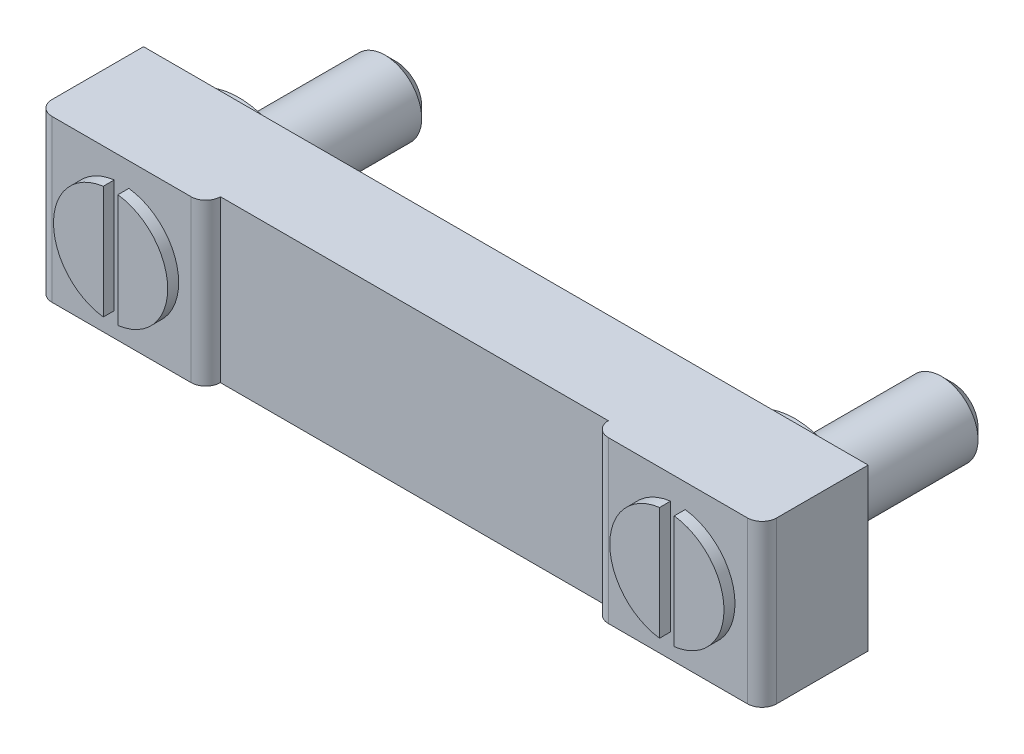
ISO-10303-21;
HEADER;
FILE_DESCRIPTION(('STEP AP214'),'2;1');
FILE_NAME('part.step','',(''),(''),'','','');
FILE_SCHEMA(('AUTOMOTIVE_DESIGN { 1 0 10303 214 1 1 1 1 }'));
ENDSEC;
DATA;
#1=APPLICATION_CONTEXT('core data for automotive mechanical design processes');
#2=APPLICATION_PROTOCOL_DEFINITION('international standard','automotive_design',2000,#1);
#3=PRODUCT_CONTEXT('',#1,'mechanical');
#4=PRODUCT('Part','Part','',(#3));
#5=PRODUCT_RELATED_PRODUCT_CATEGORY('part','',(#4));
#6=PRODUCT_DEFINITION_FORMATION('','',#4);
#7=PRODUCT_DEFINITION_CONTEXT('part definition',#1,'design');
#8=PRODUCT_DEFINITION('design','',#6,#7);
#9=PRODUCT_DEFINITION_SHAPE('','',#8);
#10=(LENGTH_UNIT() NAMED_UNIT(*) SI_UNIT(.MILLI.,.METRE.));
#11=(NAMED_UNIT(*) PLANE_ANGLE_UNIT() SI_UNIT($,.RADIAN.));
#12=(NAMED_UNIT(*) SI_UNIT($,.STERADIAN.) SOLID_ANGLE_UNIT());
#13=UNCERTAINTY_MEASURE_WITH_UNIT(LENGTH_MEASURE(1.E-05),#10,'distance_accuracy_value','');
#14=(GEOMETRIC_REPRESENTATION_CONTEXT(3) GLOBAL_UNCERTAINTY_ASSIGNED_CONTEXT((#13)) GLOBAL_UNIT_ASSIGNED_CONTEXT((#10,
#11,#12)) REPRESENTATION_CONTEXT('',''));
#15=CARTESIAN_POINT('',(0.,0.,0.));
#16=DIRECTION('',(0.,0.,1.));
#17=DIRECTION('',(1.,0.,0.));
#18=AXIS2_PLACEMENT_3D('',#15,#16,#17);
#19=CARTESIAN_POINT('',(10.,-11.,0.));
#20=DIRECTION('',(0.,0.,1.));
#21=DIRECTION('',(0.,1.,0.));
#22=AXIS2_PLACEMENT_3D('',#19,#20,#21);
#23=PLANE('',#22);
#24=CARTESIAN_POINT('',(76.,0.,0.));
#25=DIRECTION('',(0.,0.,1.));
#26=DIRECTION('',(0.,1.,0.));
#27=AXIS2_PLACEMENT_3D('',#24,#25,#26);
#28=CIRCLE('',#27,10.);
#29=CARTESIAN_POINT('',(76.,10.,0.));
#30=VERTEX_POINT('',#29);
#31=EDGE_CURVE('E142',#30,#30,#28,.T.);
#32=ORIENTED_EDGE('',*,*,#31,.F.);
#33=EDGE_LOOP('',(#32));
#34=FACE_BOUND('',#33,.T.);
#35=CARTESIAN_POINT('',(76.,0.,0.));
#36=DIRECTION('',(0.,0.,1.));
#37=DIRECTION('',(0.,1.,0.));
#38=AXIS2_PLACEMENT_3D('',#35,#36,#37);
#39=CIRCLE('',#38,5.);
#40=CARTESIAN_POINT('',(76.,5.,0.));
#41=VERTEX_POINT('',#40);
#42=EDGE_CURVE('E299',#41,#41,#39,.F.);
#43=ORIENTED_EDGE('',*,*,#42,.F.);
#44=EDGE_LOOP('',(#43));
#45=FACE_BOUND('',#44,.T.);
#46=ADVANCED_FACE('F14',(#34,#45),#23,.F.);
#47=CARTESIAN_POINT('',(86.,-11.,1.49999999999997));
#48=DIRECTION('',(0.,0.,1.));
#49=DIRECTION('',(-1.,0.,0.));
#50=AXIS2_PLACEMENT_3D('',#47,#48,#49);
#51=PLANE('',#50);
#52=DIRECTION('',(1.,0.,0.));
#53=VECTOR('',#52,1.);
#54=CARTESIAN_POINT('',(86.,11.,1.49999999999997));
#55=LINE('',#54,#53);
#56=CARTESIAN_POINT('',(-11.5,11.,1.49999999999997));
#57=VERTEX_POINT('',#56);
#58=CARTESIAN_POINT('',(87.5,11.,1.49999999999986));
#59=VERTEX_POINT('',#58);
#60=EDGE_CURVE('E220',#57,#59,#55,.T.);
#61=ORIENTED_EDGE('',*,*,#60,.T.);
#62=DIRECTION('',(0.,1.,0.));
#63=VECTOR('',#62,1.);
#64=CARTESIAN_POINT('',(87.5,-11.,1.49999999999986));
#65=LINE('',#64,#63);
#66=CARTESIAN_POINT('',(87.5,-11.,1.49999999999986));
#67=VERTEX_POINT('',#66);
#68=EDGE_CURVE('E278',#67,#59,#65,.T.);
#69=ORIENTED_EDGE('',*,*,#68,.F.);
#70=DIRECTION('',(1.,0.,0.));
#71=VECTOR('',#70,1.);
#72=CARTESIAN_POINT('',(-11.5,-11.,1.49999999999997));
#73=LINE('',#72,#71);
#74=CARTESIAN_POINT('',(-11.5,-11.,1.49999999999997));
#75=VERTEX_POINT('',#74);
#76=EDGE_CURVE('E241',#75,#67,#73,.T.);
#77=ORIENTED_EDGE('',*,*,#76,.F.);
#78=DIRECTION('',(0.,1.,0.));
#79=VECTOR('',#78,1.);
#80=CARTESIAN_POINT('',(-11.5,-11.,1.49999999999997));
#81=LINE('',#80,#79);
#82=EDGE_CURVE('E281',#75,#57,#81,.T.);
#83=ORIENTED_EDGE('',*,*,#82,.T.);
#84=EDGE_LOOP('',(#61,#69,#77,#83));
#85=FACE_BOUND('',#84,.T.);
#86=CARTESIAN_POINT('',(0.,0.,1.49999999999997));
#87=DIRECTION('',(0.,0.,1.));
#88=DIRECTION('',(0.,1.,0.));
#89=AXIS2_PLACEMENT_3D('',#86,#87,#88);
#90=CIRCLE('',#89,10.);
#91=CARTESIAN_POINT('',(0.,10.,1.49999999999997));
#92=VERTEX_POINT('',#91);
#93=EDGE_CURVE('E177',#92,#92,#90,.F.);
#94=ORIENTED_EDGE('',*,*,#93,.F.);
#95=EDGE_LOOP('',(#94));
#96=FACE_BOUND('',#95,.T.);
#97=CARTESIAN_POINT('',(76.,0.,1.50000000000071));
#98=DIRECTION('',(0.,0.,1.));
#99=DIRECTION('',(-1.,0.,0.));
#100=AXIS2_PLACEMENT_3D('',#97,#98,#99);
#101=CIRCLE('',#100,10.);
#102=CARTESIAN_POINT('',(66.,0.,1.50000000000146));
#103=VERTEX_POINT('',#102);
#104=EDGE_CURVE('E296',#103,#103,#101,.F.);
#105=ORIENTED_EDGE('',*,*,#104,.F.);
#106=EDGE_LOOP('',(#105));
#107=FACE_BOUND('',#106,.T.);
#108=ADVANCED_FACE('F319',(#85,#96,#107),#51,.F.);
#109=CARTESIAN_POINT('',(85.5,-11.,16.));
#110=DIRECTION('',(0.,0.,-1.));
#111=DIRECTION('',(0.,-1.,0.));
#112=AXIS2_PLACEMENT_3D('',#109,#110,#111);
#113=PLANE('',#112);
#114=CARTESIAN_POINT('',(76.,0.,16.));
#115=DIRECTION('',(0.,0.,1.));
#116=DIRECTION('',(0.,1.,0.));
#117=AXIS2_PLACEMENT_3D('',#114,#115,#116);
#118=CIRCLE('',#117,7.8);
#119=CARTESIAN_POINT('',(75.,7.73563184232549,16.));
#120=VERTEX_POINT('',#119);
#121=CARTESIAN_POINT('',(75.,-7.73563184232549,16.));
#122=VERTEX_POINT('',#121);
#123=EDGE_CURVE('E156',#120,#122,#118,.T.);
#124=ORIENTED_EDGE('',*,*,#123,.F.);
#125=DIRECTION('',(0.,1.,0.));
#126=VECTOR('',#125,1.);
#127=CARTESIAN_POINT('',(75.,-7.73563184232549,16.));
#128=LINE('',#127,#126);
#129=EDGE_CURVE('E35',#122,#120,#128,.T.);
#130=ORIENTED_EDGE('',*,*,#129,.F.);
#131=EDGE_LOOP('',(#124,#130));
#132=FACE_BOUND('',#131,.T.);
#133=DIRECTION('',(-1.,0.,0.));
#134=VECTOR('',#133,1.);
#135=CARTESIAN_POINT('',(85.5,11.,16.));
#136=LINE('',#135,#134);
#137=CARTESIAN_POINT('',(85.5,11.,16.));
#138=VERTEX_POINT('',#137);
#139=CARTESIAN_POINT('',(66.5,11.,16.));
#140=VERTEX_POINT('',#139);
#141=EDGE_CURVE('E226',#138,#140,#136,.T.);
#142=ORIENTED_EDGE('',*,*,#141,.T.);
#143=DIRECTION('',(0.,1.,0.));
#144=VECTOR('',#143,1.);
#145=CARTESIAN_POINT('',(66.5,-11.,16.));
#146=LINE('',#145,#144);
#147=CARTESIAN_POINT('',(66.5,-11.,16.));
#148=VERTEX_POINT('',#147);
#149=EDGE_CURVE('E269',#148,#140,#146,.T.);
#150=ORIENTED_EDGE('',*,*,#149,.F.);
#151=DIRECTION('',(-1.,0.,0.));
#152=VECTOR('',#151,1.);
#153=CARTESIAN_POINT('',(85.5,-11.,16.));
#154=LINE('',#153,#152);
#155=CARTESIAN_POINT('',(85.5,-11.,16.));
#156=VERTEX_POINT('',#155);
#157=EDGE_CURVE('E247',#156,#148,#154,.T.);
#158=ORIENTED_EDGE('',*,*,#157,.F.);
#159=DIRECTION('',(0.,1.,0.));
#160=VECTOR('',#159,1.);
#161=CARTESIAN_POINT('',(85.5,-11.,16.));
#162=LINE('',#161,#160);
#163=EDGE_CURVE('E272',#156,#138,#162,.T.);
#164=ORIENTED_EDGE('',*,*,#163,.T.);
#165=EDGE_LOOP('',(#142,#150,#158,#164));
#166=FACE_BOUND('',#165,.T.);
#167=CARTESIAN_POINT('',(76.,0.,16.));
#168=DIRECTION('',(0.,0.,1.));
#169=DIRECTION('',(0.,1.,0.));
#170=AXIS2_PLACEMENT_3D('',#167,#168,#169);
#171=CIRCLE('',#170,7.8);
#172=CARTESIAN_POINT('',(77.,-7.73563184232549,16.));
#173=VERTEX_POINT('',#172);
#174=CARTESIAN_POINT('',(77.,7.73563184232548,16.));
#175=VERTEX_POINT('',#174);
#176=EDGE_CURVE('E137',#173,#175,#171,.T.);
#177=ORIENTED_EDGE('',*,*,#176,.F.);
#178=DIRECTION('',(0.,-1.,0.));
#179=VECTOR('',#178,1.);
#180=CARTESIAN_POINT('',(77.,-7.73563184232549,16.));
#181=LINE('',#180,#179);
#182=EDGE_CURVE('E28',#175,#173,#181,.T.);
#183=ORIENTED_EDGE('',*,*,#182,.F.);
#184=EDGE_LOOP('',(#177,#183));
#185=FACE_BOUND('',#184,.T.);
#186=ADVANCED_FACE('F138',(#132,#166,#185),#113,.F.);
#187=CARTESIAN_POINT('',(10.,-11.,0.));
#188=DIRECTION('',(0.,0.,1.));
#189=DIRECTION('',(0.,1.,0.));
#190=AXIS2_PLACEMENT_3D('',#187,#188,#189);
#191=PLANE('',#190);
#192=CARTESIAN_POINT('',(0.,0.,0.));
#193=DIRECTION('',(0.,0.,-1.));
#194=DIRECTION('',(0.,-1.,0.));
#195=AXIS2_PLACEMENT_3D('',#192,#193,#194);
#196=CIRCLE('',#195,10.);
#197=CARTESIAN_POINT('',(0.,-10.,0.));
#198=VERTEX_POINT('',#197);
#199=EDGE_CURVE('E174',#198,#198,#196,.T.);
#200=ORIENTED_EDGE('',*,*,#199,.T.);
#201=EDGE_LOOP('',(#200));
#202=FACE_BOUND('',#201,.T.);
#203=CARTESIAN_POINT('',(0.,0.,0.));
#204=DIRECTION('',(0.,0.,1.));
#205=DIRECTION('',(0.,1.,0.));
#206=AXIS2_PLACEMENT_3D('',#203,#204,#205);
#207=CIRCLE('',#206,5.);
#208=CARTESIAN_POINT('',(0.,5.,0.));
#209=VERTEX_POINT('',#208);
#210=EDGE_CURVE('E287',#209,#209,#207,.F.);
#211=ORIENTED_EDGE('',*,*,#210,.F.);
#212=EDGE_LOOP('',(#211));
#213=FACE_BOUND('',#212,.T.);
#214=ADVANCED_FACE('F408',(#202,#213),#191,.F.);
#215=CARTESIAN_POINT('',(-9.5,-11.,16.));
#216=DIRECTION('',(0.,0.,-1.));
#217=DIRECTION('',(0.,-1.,0.));
#218=AXIS2_PLACEMENT_3D('',#215,#216,#217);
#219=PLANE('',#218);
#220=CARTESIAN_POINT('',(0.,0.,16.));
#221=DIRECTION('',(0.,0.,1.));
#222=DIRECTION('',(0.,1.,0.));
#223=AXIS2_PLACEMENT_3D('',#220,#221,#222);
#224=CIRCLE('',#223,7.8);
#225=CARTESIAN_POINT('',(-1.,7.73563184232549,16.));
#226=VERTEX_POINT('',#225);
#227=CARTESIAN_POINT('',(-1.,-7.73563184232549,16.));
#228=VERTEX_POINT('',#227);
#229=EDGE_CURVE('E197',#226,#228,#224,.T.);
#230=ORIENTED_EDGE('',*,*,#229,.F.);
#231=DIRECTION('',(0.,1.,0.));
#232=VECTOR('',#231,1.);
#233=CARTESIAN_POINT('',(-1.,-7.73563184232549,16.));
#234=LINE('',#233,#232);
#235=EDGE_CURVE('E200',#228,#226,#234,.T.);
#236=ORIENTED_EDGE('',*,*,#235,.F.);
#237=EDGE_LOOP('',(#230,#236));
#238=FACE_BOUND('',#237,.T.);
#239=DIRECTION('',(-1.,0.,0.));
#240=VECTOR('',#239,1.);
#241=CARTESIAN_POINT('',(-9.5,11.,16.));
#242=LINE('',#241,#240);
#243=CARTESIAN_POINT('',(9.4999999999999,11.,16.));
#244=VERTEX_POINT('',#243);
#245=CARTESIAN_POINT('',(-9.5,11.,16.));
#246=VERTEX_POINT('',#245);
#247=EDGE_CURVE('E234',#244,#246,#242,.T.);
#248=ORIENTED_EDGE('',*,*,#247,.T.);
#249=DIRECTION('',(0.,1.,0.));
#250=VECTOR('',#249,1.);
#251=CARTESIAN_POINT('',(-9.5,-11.,16.));
#252=LINE('',#251,#250);
#253=CARTESIAN_POINT('',(-9.5,-11.,16.));
#254=VERTEX_POINT('',#253);
#255=EDGE_CURVE('E257',#254,#246,#252,.T.);
#256=ORIENTED_EDGE('',*,*,#255,.F.);
#257=DIRECTION('',(-1.,0.,0.));
#258=VECTOR('',#257,1.);
#259=CARTESIAN_POINT('',(-9.5,-11.,16.));
#260=LINE('',#259,#258);
#261=CARTESIAN_POINT('',(9.4999999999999,-11.,16.));
#262=VERTEX_POINT('',#261);
#263=EDGE_CURVE('E255',#262,#254,#260,.T.);
#264=ORIENTED_EDGE('',*,*,#263,.F.);
#265=DIRECTION('',(0.,1.,0.));
#266=VECTOR('',#265,1.);
#267=CARTESIAN_POINT('',(9.4999999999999,-11.,16.));
#268=LINE('',#267,#266);
#269=EDGE_CURVE('E260',#262,#244,#268,.T.);
#270=ORIENTED_EDGE('',*,*,#269,.T.);
#271=EDGE_LOOP('',(#248,#256,#264,#270));
#272=FACE_BOUND('',#271,.T.);
#273=CARTESIAN_POINT('',(0.,0.,16.));
#274=DIRECTION('',(0.,0.,1.));
#275=DIRECTION('',(0.,1.,0.));
#276=AXIS2_PLACEMENT_3D('',#273,#274,#275);
#277=CIRCLE('',#276,7.8);
#278=CARTESIAN_POINT('',(1.,-7.73563184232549,16.));
#279=VERTEX_POINT('',#278);
#280=CARTESIAN_POINT('',(1.,7.73563184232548,16.));
#281=VERTEX_POINT('',#280);
#282=EDGE_CURVE('E180',#279,#281,#277,.T.);
#283=ORIENTED_EDGE('',*,*,#282,.F.);
#284=DIRECTION('',(0.,-1.,0.));
#285=VECTOR('',#284,1.);
#286=CARTESIAN_POINT('',(1.,-7.73563184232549,16.));
#287=LINE('',#286,#285);
#288=EDGE_CURVE('E183',#281,#279,#287,.T.);
#289=ORIENTED_EDGE('',*,*,#288,.F.);
#290=EDGE_LOOP('',(#283,#289));
#291=FACE_BOUND('',#290,.T.);
#292=ADVANCED_FACE('F405',(#238,#272,#291),#219,.F.);
#293=CARTESIAN_POINT('',(-9.5,-11.,14.));
#294=DIRECTION('',(0.,1.,0.));
#295=DIRECTION('',(0.,0.,-1.));
#296=AXIS2_PLACEMENT_3D('',#293,#294,#295);
#297=CYLINDRICAL_SURFACE('',#296,2.);
#298=CARTESIAN_POINT('',(-9.5,11.,14.));
#299=DIRECTION('',(0.,-1.,0.));
#300=DIRECTION('',(0.,0.,-1.));
#301=AXIS2_PLACEMENT_3D('',#298,#299,#300);
#302=CIRCLE('',#301,2.);
#303=CARTESIAN_POINT('',(-11.5,11.,14.));
#304=VERTEX_POINT('',#303);
#305=EDGE_CURVE('E214',#246,#304,#302,.T.);
#306=ORIENTED_EDGE('',*,*,#305,.T.);
#307=DIRECTION('',(0.,1.,0.));
#308=VECTOR('',#307,1.);
#309=CARTESIAN_POINT('',(-11.5,-11.,14.));
#310=LINE('',#309,#308);
#311=CARTESIAN_POINT('',(-11.5,-11.,14.));
#312=VERTEX_POINT('',#311);
#313=EDGE_CURVE('E284',#312,#304,#310,.T.);
#314=ORIENTED_EDGE('',*,*,#313,.F.);
#315=CARTESIAN_POINT('',(-9.5,-11.,14.));
#316=DIRECTION('',(0.,-1.,0.));
#317=DIRECTION('',(0.,0.,-1.));
#318=AXIS2_PLACEMENT_3D('',#315,#316,#317);
#319=CIRCLE('',#318,2.);
#320=EDGE_CURVE('E236',#254,#312,#319,.T.);
#321=ORIENTED_EDGE('',*,*,#320,.F.);
#322=ORIENTED_EDGE('',*,*,#255,.T.);
#323=EDGE_LOOP('',(#306,#314,#321,#322));
#324=FACE_BOUND('',#323,.T.);
#325=ADVANCED_FACE('F16',(#324),#297,.T.);
#326=CARTESIAN_POINT('',(-11.5,-11.,14.));
#327=DIRECTION('',(1.,0.,0.));
#328=DIRECTION('',(0.,1.,0.));
#329=AXIS2_PLACEMENT_3D('',#326,#327,#328);
#330=PLANE('',#329);
#331=DIRECTION('',(0.,0.,-1.));
#332=VECTOR('',#331,1.);
#333=CARTESIAN_POINT('',(-11.5,11.,14.));
#334=LINE('',#333,#332);
#335=EDGE_CURVE('E217',#304,#57,#334,.T.);
#336=ORIENTED_EDGE('',*,*,#335,.T.);
#337=ORIENTED_EDGE('',*,*,#82,.F.);
#338=DIRECTION('',(0.,0.,-1.));
#339=VECTOR('',#338,1.);
#340=CARTESIAN_POINT('',(-11.5,-11.,14.));
#341=LINE('',#340,#339);
#342=EDGE_CURVE('E239',#312,#75,#341,.T.);
#343=ORIENTED_EDGE('',*,*,#342,.F.);
#344=ORIENTED_EDGE('',*,*,#313,.T.);
#345=EDGE_LOOP('',(#336,#337,#343,#344));
#346=FACE_BOUND('',#345,.T.);
#347=ADVANCED_FACE('F429',(#346),#330,.F.);
#348=CARTESIAN_POINT('',(87.5,-11.,14.));
#349=DIRECTION('',(-1.,0.,0.));
#350=DIRECTION('',(0.,-1.,0.));
#351=AXIS2_PLACEMENT_3D('',#348,#349,#350);
#352=PLANE('',#351);
#353=DIRECTION('',(0.,0.,1.));
#354=VECTOR('',#353,1.);
#355=CARTESIAN_POINT('',(87.5,11.,14.));
#356=LINE('',#355,#354);
#357=CARTESIAN_POINT('',(87.5,11.,14.));
#358=VERTEX_POINT('',#357);
#359=EDGE_CURVE('E222',#59,#358,#356,.T.);
#360=ORIENTED_EDGE('',*,*,#359,.T.);
#361=DIRECTION('',(0.,1.,0.));
#362=VECTOR('',#361,1.);
#363=CARTESIAN_POINT('',(87.5,-11.,14.));
#364=LINE('',#363,#362);
#365=CARTESIAN_POINT('',(87.5,-11.,14.));
#366=VERTEX_POINT('',#365);
#367=EDGE_CURVE('E275',#366,#358,#364,.T.);
#368=ORIENTED_EDGE('',*,*,#367,.F.);
#369=DIRECTION('',(0.,0.,1.));
#370=VECTOR('',#369,1.);
#371=CARTESIAN_POINT('',(87.5,-11.,14.));
#372=LINE('',#371,#370);
#373=EDGE_CURVE('E243',#67,#366,#372,.T.);
#374=ORIENTED_EDGE('',*,*,#373,.F.);
#375=ORIENTED_EDGE('',*,*,#68,.T.);
#376=EDGE_LOOP('',(#360,#368,#374,#375));
#377=FACE_BOUND('',#376,.T.);
#378=ADVANCED_FACE('F426',(#377),#352,.F.);
#379=CARTESIAN_POINT('',(85.5,-11.,14.));
#380=DIRECTION('',(0.,1.,0.));
#381=DIRECTION('',(0.,0.,-1.));
#382=AXIS2_PLACEMENT_3D('',#379,#380,#381);
#383=CYLINDRICAL_SURFACE('',#382,2.);
#384=CARTESIAN_POINT('',(85.5,11.,14.));
#385=DIRECTION('',(0.,-1.,0.));
#386=DIRECTION('',(0.,0.,-1.));
#387=AXIS2_PLACEMENT_3D('',#384,#385,#386);
#388=CIRCLE('',#387,2.);
#389=EDGE_CURVE('E224',#358,#138,#388,.T.);
#390=ORIENTED_EDGE('',*,*,#389,.T.);
#391=ORIENTED_EDGE('',*,*,#163,.F.);
#392=CARTESIAN_POINT('',(85.5,-11.,14.));
#393=DIRECTION('',(0.,-1.,0.));
#394=DIRECTION('',(0.,0.,-1.));
#395=AXIS2_PLACEMENT_3D('',#392,#393,#394);
#396=CIRCLE('',#395,2.);
#397=EDGE_CURVE('E245',#366,#156,#396,.T.);
#398=ORIENTED_EDGE('',*,*,#397,.F.);
#399=ORIENTED_EDGE('',*,*,#367,.T.);
#400=EDGE_LOOP('',(#390,#391,#398,#399));
#401=FACE_BOUND('',#400,.T.);
#402=ADVANCED_FACE('F420',(#401),#383,.T.);
#403=CARTESIAN_POINT('',(66.5,-11.,14.));
#404=DIRECTION('',(0.,1.,0.));
#405=DIRECTION('',(0.,0.,-1.));
#406=AXIS2_PLACEMENT_3D('',#403,#404,#405);
#407=CYLINDRICAL_SURFACE('',#406,2.);
#408=CARTESIAN_POINT('',(66.5,11.,14.));
#409=DIRECTION('',(0.,-1.,0.));
#410=DIRECTION('',(0.,0.,-1.));
#411=AXIS2_PLACEMENT_3D('',#408,#409,#410);
#412=CIRCLE('',#411,2.);
#413=CARTESIAN_POINT('',(64.5,11.,14.));
#414=VERTEX_POINT('',#413);
#415=EDGE_CURVE('E228',#140,#414,#412,.T.);
#416=ORIENTED_EDGE('',*,*,#415,.T.);
#417=DIRECTION('',(0.,1.,0.));
#418=VECTOR('',#417,1.);
#419=CARTESIAN_POINT('',(64.5,-11.,14.));
#420=LINE('',#419,#418);
#421=CARTESIAN_POINT('',(64.5,-11.,14.));
#422=VERTEX_POINT('',#421);
#423=EDGE_CURVE('E266',#422,#414,#420,.T.);
#424=ORIENTED_EDGE('',*,*,#423,.F.);
#425=CARTESIAN_POINT('',(66.5,-11.,14.));
#426=DIRECTION('',(0.,-1.,0.));
#427=DIRECTION('',(0.,0.,-1.));
#428=AXIS2_PLACEMENT_3D('',#425,#426,#427);
#429=CIRCLE('',#428,2.);
#430=EDGE_CURVE('E249',#148,#422,#429,.T.);
#431=ORIENTED_EDGE('',*,*,#430,.F.);
#432=ORIENTED_EDGE('',*,*,#149,.T.);
#433=EDGE_LOOP('',(#416,#424,#431,#432));
#434=FACE_BOUND('',#433,.T.);
#435=ADVANCED_FACE('F416',(#434),#407,.T.);
#436=CARTESIAN_POINT('',(11.5,-11.,14.));
#437=DIRECTION('',(0.,0.,-1.));
#438=DIRECTION('',(0.,-1.,0.));
#439=AXIS2_PLACEMENT_3D('',#436,#437,#438);
#440=PLANE('',#439);
#441=DIRECTION('',(-1.,0.,0.));
#442=VECTOR('',#441,1.);
#443=CARTESIAN_POINT('',(11.5,11.,14.));
#444=LINE('',#443,#442);
#445=CARTESIAN_POINT('',(11.5,11.,14.));
#446=VERTEX_POINT('',#445);
#447=EDGE_CURVE('E230',#414,#446,#444,.T.);
#448=ORIENTED_EDGE('',*,*,#447,.T.);
#449=DIRECTION('',(0.,1.,0.));
#450=VECTOR('',#449,1.);
#451=CARTESIAN_POINT('',(11.5,-11.,14.));
#452=LINE('',#451,#450);
#453=CARTESIAN_POINT('',(11.5,-11.,14.));
#454=VERTEX_POINT('',#453);
#455=EDGE_CURVE('E263',#454,#446,#452,.T.);
#456=ORIENTED_EDGE('',*,*,#455,.F.);
#457=DIRECTION('',(-1.,0.,0.));
#458=VECTOR('',#457,1.);
#459=CARTESIAN_POINT('',(11.5,-11.,14.));
#460=LINE('',#459,#458);
#461=EDGE_CURVE('E251',#422,#454,#460,.T.);
#462=ORIENTED_EDGE('',*,*,#461,.F.);
#463=ORIENTED_EDGE('',*,*,#423,.T.);
#464=EDGE_LOOP('',(#448,#456,#462,#463));
#465=FACE_BOUND('',#464,.T.);
#466=ADVANCED_FACE('F412',(#465),#440,.F.);
#467=CARTESIAN_POINT('',(9.4999999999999,-11.,14.));
#468=DIRECTION('',(0.,1.,0.));
#469=DIRECTION('',(0.,0.,-1.));
#470=AXIS2_PLACEMENT_3D('',#467,#468,#469);
#471=CYLINDRICAL_SURFACE('',#470,2.);
#472=CARTESIAN_POINT('',(9.4999999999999,11.,14.));
#473=DIRECTION('',(0.,-1.,0.));
#474=DIRECTION('',(0.,0.,-1.));
#475=AXIS2_PLACEMENT_3D('',#472,#473,#474);
#476=CIRCLE('',#475,2.);
#477=EDGE_CURVE('E232',#446,#244,#476,.T.);
#478=ORIENTED_EDGE('',*,*,#477,.T.);
#479=ORIENTED_EDGE('',*,*,#269,.F.);
#480=CARTESIAN_POINT('',(9.4999999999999,-11.,14.));
#481=DIRECTION('',(0.,-1.,0.));
#482=DIRECTION('',(0.,0.,-1.));
#483=AXIS2_PLACEMENT_3D('',#480,#481,#482);
#484=CIRCLE('',#483,2.);
#485=EDGE_CURVE('E253',#454,#262,#484,.T.);
#486=ORIENTED_EDGE('',*,*,#485,.F.);
#487=ORIENTED_EDGE('',*,*,#455,.T.);
#488=EDGE_LOOP('',(#478,#479,#486,#487));
#489=FACE_BOUND('',#488,.T.);
#490=ADVANCED_FACE('F403',(#489),#471,.T.);
#491=CARTESIAN_POINT('',(-9.5,-11.,14.));
#492=DIRECTION('',(0.,1.,0.));
#493=DIRECTION('',(0.,0.,-1.));
#494=AXIS2_PLACEMENT_3D('',#491,#492,#493);
#495=PLANE('',#494);
#496=ORIENTED_EDGE('',*,*,#76,.T.);
#497=ORIENTED_EDGE('',*,*,#373,.T.);
#498=ORIENTED_EDGE('',*,*,#397,.T.);
#499=ORIENTED_EDGE('',*,*,#157,.T.);
#500=ORIENTED_EDGE('',*,*,#430,.T.);
#501=ORIENTED_EDGE('',*,*,#461,.T.);
#502=ORIENTED_EDGE('',*,*,#485,.T.);
#503=ORIENTED_EDGE('',*,*,#263,.T.);
#504=ORIENTED_EDGE('',*,*,#320,.T.);
#505=ORIENTED_EDGE('',*,*,#342,.T.);
#506=EDGE_LOOP('',(#496,#497,#498,#499,#500,#501,#502,#503,#504,#505));
#507=FACE_BOUND('',#506,.T.);
#508=ADVANCED_FACE('F399',(#507),#495,.F.);
#509=CARTESIAN_POINT('',(-9.5,11.,14.));
#510=DIRECTION('',(0.,1.,0.));
#511=DIRECTION('',(0.,0.,-1.));
#512=AXIS2_PLACEMENT_3D('',#509,#510,#511);
#513=PLANE('',#512);
#514=ORIENTED_EDGE('',*,*,#60,.F.);
#515=ORIENTED_EDGE('',*,*,#335,.F.);
#516=ORIENTED_EDGE('',*,*,#305,.F.);
#517=ORIENTED_EDGE('',*,*,#247,.F.);
#518=ORIENTED_EDGE('',*,*,#477,.F.);
#519=ORIENTED_EDGE('',*,*,#447,.F.);
#520=ORIENTED_EDGE('',*,*,#415,.F.);
#521=ORIENTED_EDGE('',*,*,#141,.F.);
#522=ORIENTED_EDGE('',*,*,#389,.F.);
#523=ORIENTED_EDGE('',*,*,#359,.F.);
#524=EDGE_LOOP('',(#514,#515,#516,#517,#518,#519,#520,#521,#522,#523));
#525=FACE_BOUND('',#524,.T.);
#526=ADVANCED_FACE('F395',(#525),#513,.T.);
#527=CARTESIAN_POINT('',(0.,0.,17.5));
#528=DIRECTION('',(0.,0.,-1.));
#529=DIRECTION('',(0.,-1.,0.));
#530=AXIS2_PLACEMENT_3D('',#527,#528,#529);
#531=CYLINDRICAL_SURFACE('',#530,7.8);
#532=ORIENTED_EDGE('',*,*,#229,.T.);
#533=DIRECTION('',(0.,0.,-1.));
#534=VECTOR('',#533,1.);
#535=CARTESIAN_POINT('',(-1.,-7.73563184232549,17.5));
#536=LINE('',#535,#534);
#537=CARTESIAN_POINT('',(-1.,-7.73563184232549,17.5));
#538=VERTEX_POINT('',#537);
#539=EDGE_CURVE('E211',#538,#228,#536,.T.);
#540=ORIENTED_EDGE('',*,*,#539,.F.);
#541=CARTESIAN_POINT('',(0.,0.,17.5));
#542=DIRECTION('',(0.,0.,1.));
#543=DIRECTION('',(0.,1.,0.));
#544=AXIS2_PLACEMENT_3D('',#541,#542,#543);
#545=CIRCLE('',#544,7.8);
#546=CARTESIAN_POINT('',(-1.,7.73563184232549,17.5));
#547=VERTEX_POINT('',#546);
#548=EDGE_CURVE('E203',#547,#538,#545,.T.);
#549=ORIENTED_EDGE('',*,*,#548,.F.);
#550=DIRECTION('',(0.,0.,-1.));
#551=VECTOR('',#550,1.);
#552=CARTESIAN_POINT('',(-1.,7.73563184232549,17.5));
#553=LINE('',#552,#551);
#554=EDGE_CURVE('E208',#547,#226,#553,.T.);
#555=ORIENTED_EDGE('',*,*,#554,.T.);
#556=EDGE_LOOP('',(#532,#540,#549,#555));
#557=FACE_BOUND('',#556,.T.);
#558=ADVANCED_FACE('F391',(#557),#531,.T.);
#559=CARTESIAN_POINT('',(-1.,-7.73563184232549,17.5));
#560=DIRECTION('',(-1.,0.,0.));
#561=DIRECTION('',(0.,-1.,0.));
#562=AXIS2_PLACEMENT_3D('',#559,#560,#561);
#563=PLANE('',#562);
#564=ORIENTED_EDGE('',*,*,#235,.T.);
#565=ORIENTED_EDGE('',*,*,#554,.F.);
#566=DIRECTION('',(0.,1.,0.));
#567=VECTOR('',#566,1.);
#568=CARTESIAN_POINT('',(-1.,-7.73563184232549,17.5));
#569=LINE('',#568,#567);
#570=EDGE_CURVE('E206',#538,#547,#569,.T.);
#571=ORIENTED_EDGE('',*,*,#570,.F.);
#572=ORIENTED_EDGE('',*,*,#539,.T.);
#573=EDGE_LOOP('',(#564,#565,#571,#572));
#574=FACE_BOUND('',#573,.T.);
#575=ADVANCED_FACE('F387',(#574),#563,.F.);
#576=CARTESIAN_POINT('',(0.,0.,17.5));
#577=DIRECTION('',(0.,0.,1.));
#578=DIRECTION('',(0.,1.,0.));
#579=AXIS2_PLACEMENT_3D('',#576,#577,#578);
#580=PLANE('',#579);
#581=ORIENTED_EDGE('',*,*,#548,.T.);
#582=ORIENTED_EDGE('',*,*,#570,.T.);
#583=EDGE_LOOP('',(#581,#582));
#584=FACE_BOUND('',#583,.T.);
#585=ADVANCED_FACE('F383',(#584),#580,.T.);
#586=CARTESIAN_POINT('',(0.,0.,17.5));
#587=DIRECTION('',(0.,0.,-1.));
#588=DIRECTION('',(0.,-1.,0.));
#589=AXIS2_PLACEMENT_3D('',#586,#587,#588);
#590=CYLINDRICAL_SURFACE('',#589,7.8);
#591=ORIENTED_EDGE('',*,*,#282,.T.);
#592=DIRECTION('',(0.,0.,-1.));
#593=VECTOR('',#592,1.);
#594=CARTESIAN_POINT('',(1.,7.73563184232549,17.5));
#595=LINE('',#594,#593);
#596=CARTESIAN_POINT('',(1.,7.73563184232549,17.5));
#597=VERTEX_POINT('',#596);
#598=EDGE_CURVE('E194',#597,#281,#595,.T.);
#599=ORIENTED_EDGE('',*,*,#598,.F.);
#600=CARTESIAN_POINT('',(0.,0.,17.5));
#601=DIRECTION('',(0.,0.,1.));
#602=DIRECTION('',(0.,1.,0.));
#603=AXIS2_PLACEMENT_3D('',#600,#601,#602);
#604=CIRCLE('',#603,7.8);
#605=CARTESIAN_POINT('',(1.,-7.73563184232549,17.5));
#606=VERTEX_POINT('',#605);
#607=EDGE_CURVE('E186',#606,#597,#604,.T.);
#608=ORIENTED_EDGE('',*,*,#607,.F.);
#609=DIRECTION('',(0.,0.,-1.));
#610=VECTOR('',#609,1.);
#611=CARTESIAN_POINT('',(1.,-7.73563184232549,17.5));
#612=LINE('',#611,#610);
#613=EDGE_CURVE('E191',#606,#279,#612,.T.);
#614=ORIENTED_EDGE('',*,*,#613,.T.);
#615=EDGE_LOOP('',(#591,#599,#608,#614));
#616=FACE_BOUND('',#615,.T.);
#617=ADVANCED_FACE('F379',(#616),#590,.T.);
#618=CARTESIAN_POINT('',(1.,-7.73563184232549,17.5));
#619=DIRECTION('',(1.,0.,0.));
#620=DIRECTION('',(0.,1.,0.));
#621=AXIS2_PLACEMENT_3D('',#618,#619,#620);
#622=PLANE('',#621);
#623=ORIENTED_EDGE('',*,*,#288,.T.);
#624=ORIENTED_EDGE('',*,*,#613,.F.);
#625=DIRECTION('',(0.,-1.,0.));
#626=VECTOR('',#625,1.);
#627=CARTESIAN_POINT('',(1.,-7.73563184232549,17.5));
#628=LINE('',#627,#626);
#629=EDGE_CURVE('E189',#597,#606,#628,.T.);
#630=ORIENTED_EDGE('',*,*,#629,.F.);
#631=ORIENTED_EDGE('',*,*,#598,.T.);
#632=EDGE_LOOP('',(#623,#624,#630,#631));
#633=FACE_BOUND('',#632,.T.);
#634=ADVANCED_FACE('F375',(#633),#622,.F.);
#635=CARTESIAN_POINT('',(0.,0.,17.5));
#636=DIRECTION('',(0.,0.,1.));
#637=DIRECTION('',(0.,1.,0.));
#638=AXIS2_PLACEMENT_3D('',#635,#636,#637);
#639=PLANE('',#638);
#640=ORIENTED_EDGE('',*,*,#607,.T.);
#641=ORIENTED_EDGE('',*,*,#629,.T.);
#642=EDGE_LOOP('',(#640,#641));
#643=FACE_BOUND('',#642,.T.);
#644=ADVANCED_FACE('F371',(#643),#639,.T.);
#645=CARTESIAN_POINT('',(0.,0.,29.7842712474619));
#646=DIRECTION('',(0.,0.,-1.));
#647=DIRECTION('',(0.,-1.,0.));
#648=AXIS2_PLACEMENT_3D('',#645,#646,#647);
#649=CYLINDRICAL_SURFACE('',#648,10.);
#650=ORIENTED_EDGE('',*,*,#199,.F.);
#651=EDGE_LOOP('',(#650));
#652=FACE_BOUND('',#651,.T.);
#653=ORIENTED_EDGE('',*,*,#93,.T.);
#654=EDGE_LOOP('',(#653));
#655=FACE_BOUND('',#654,.T.);
#656=ADVANCED_FACE('F367',(#652,#655),#649,.T.);
#657=CARTESIAN_POINT('',(0.,0.,-21.5));
#658=DIRECTION('',(0.,0.,1.));
#659=DIRECTION('',(0.,1.,0.));
#660=AXIS2_PLACEMENT_3D('',#657,#658,#659);
#661=CYLINDRICAL_SURFACE('',#660,5.);
#662=CARTESIAN_POINT('',(0.,0.,-20.));
#663=DIRECTION('',(0.,0.,-1.));
#664=DIRECTION('',(0.,-1.,0.));
#665=AXIS2_PLACEMENT_3D('',#662,#663,#664);
#666=CIRCLE('',#665,5.);
#667=CARTESIAN_POINT('',(0.,-5.,-20.));
#668=VERTEX_POINT('',#667);
#669=EDGE_CURVE('E293',#668,#668,#666,.F.);
#670=ORIENTED_EDGE('',*,*,#669,.T.);
#671=EDGE_LOOP('',(#670));
#672=FACE_BOUND('',#671,.T.);
#673=ORIENTED_EDGE('',*,*,#210,.T.);
#674=EDGE_LOOP('',(#673));
#675=FACE_BOUND('',#674,.T.);
#676=ADVANCED_FACE('F363',(#672,#675),#661,.T.);
#677=CARTESIAN_POINT('',(0.,0.,-21.5));
#678=DIRECTION('',(0.,0.,-1.));
#679=DIRECTION('',(0.,-1.,0.));
#680=AXIS2_PLACEMENT_3D('',#677,#678,#679);
#681=PLANE('',#680);
#682=CARTESIAN_POINT('',(0.,0.,-21.5));
#683=DIRECTION('',(0.,0.,-1.));
#684=DIRECTION('',(0.,-1.,0.));
#685=AXIS2_PLACEMENT_3D('',#682,#683,#684);
#686=CIRCLE('',#685,3.5);
#687=CARTESIAN_POINT('',(0.,-3.5,-21.5));
#688=VERTEX_POINT('',#687);
#689=EDGE_CURVE('E290',#688,#688,#686,.T.);
#690=ORIENTED_EDGE('',*,*,#689,.T.);
#691=EDGE_LOOP('',(#690));
#692=FACE_BOUND('',#691,.T.);
#693=ADVANCED_FACE('F359',(#692),#681,.T.);
#694=CARTESIAN_POINT('',(0.,0.,-21.5));
#695=DIRECTION('',(0.,0.,1.));
#696=DIRECTION('',(0.,1.,0.));
#697=AXIS2_PLACEMENT_3D('',#694,#695,#696);
#698=CONICAL_SURFACE('',#697,3.5,0.785398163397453);
#699=ORIENTED_EDGE('',*,*,#669,.F.);
#700=EDGE_LOOP('',(#699));
#701=FACE_BOUND('',#700,.T.);
#702=ORIENTED_EDGE('',*,*,#689,.F.);
#703=EDGE_LOOP('',(#702));
#704=FACE_BOUND('',#703,.T.);
#705=ADVANCED_FACE('F355',(#701,#704),#698,.T.);
#706=CARTESIAN_POINT('',(76.,0.,17.5));
#707=DIRECTION('',(0.,0.,-1.));
#708=DIRECTION('',(0.,-1.,0.));
#709=AXIS2_PLACEMENT_3D('',#706,#707,#708);
#710=CYLINDRICAL_SURFACE('',#709,7.8);
#711=ORIENTED_EDGE('',*,*,#123,.T.);
#712=DIRECTION('',(0.,0.,-1.));
#713=VECTOR('',#712,1.);
#714=CARTESIAN_POINT('',(75.,-7.73563184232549,17.5));
#715=LINE('',#714,#713);
#716=CARTESIAN_POINT('',(75.,-7.73563184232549,17.5));
#717=VERTEX_POINT('',#716);
#718=EDGE_CURVE('E172',#717,#122,#715,.T.);
#719=ORIENTED_EDGE('',*,*,#718,.F.);
#720=CARTESIAN_POINT('',(76.,0.,17.5));
#721=DIRECTION('',(0.,0.,1.));
#722=DIRECTION('',(0.,1.,0.));
#723=AXIS2_PLACEMENT_3D('',#720,#721,#722);
#724=CIRCLE('',#723,7.8);
#725=CARTESIAN_POINT('',(75.,7.73563184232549,17.5));
#726=VERTEX_POINT('',#725);
#727=EDGE_CURVE('E164',#726,#717,#724,.T.);
#728=ORIENTED_EDGE('',*,*,#727,.F.);
#729=DIRECTION('',(0.,0.,-1.));
#730=VECTOR('',#729,1.);
#731=CARTESIAN_POINT('',(75.,7.73563184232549,17.5));
#732=LINE('',#731,#730);
#733=EDGE_CURVE('E169',#726,#120,#732,.T.);
#734=ORIENTED_EDGE('',*,*,#733,.T.);
#735=EDGE_LOOP('',(#711,#719,#728,#734));
#736=FACE_BOUND('',#735,.T.);
#737=ADVANCED_FACE('F351',(#736),#710,.T.);
#738=CARTESIAN_POINT('',(75.,-7.73563184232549,17.5));
#739=DIRECTION('',(-1.,0.,0.));
#740=DIRECTION('',(0.,-1.,0.));
#741=AXIS2_PLACEMENT_3D('',#738,#739,#740);
#742=PLANE('',#741);
#743=ORIENTED_EDGE('',*,*,#129,.T.);
#744=ORIENTED_EDGE('',*,*,#733,.F.);
#745=DIRECTION('',(0.,1.,0.));
#746=VECTOR('',#745,1.);
#747=CARTESIAN_POINT('',(75.,-7.73563184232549,17.5));
#748=LINE('',#747,#746);
#749=EDGE_CURVE('E167',#717,#726,#748,.T.);
#750=ORIENTED_EDGE('',*,*,#749,.F.);
#751=ORIENTED_EDGE('',*,*,#718,.T.);
#752=EDGE_LOOP('',(#743,#744,#750,#751));
#753=FACE_BOUND('',#752,.T.);
#754=ADVANCED_FACE('F347',(#753),#742,.F.);
#755=CARTESIAN_POINT('',(76.,0.,17.5));
#756=DIRECTION('',(0.,0.,1.));
#757=DIRECTION('',(0.,1.,0.));
#758=AXIS2_PLACEMENT_3D('',#755,#756,#757);
#759=PLANE('',#758);
#760=ORIENTED_EDGE('',*,*,#727,.T.);
#761=ORIENTED_EDGE('',*,*,#749,.T.);
#762=EDGE_LOOP('',(#760,#761));
#763=FACE_BOUND('',#762,.T.);
#764=ADVANCED_FACE('F344',(#763),#759,.T.);
#765=CARTESIAN_POINT('',(76.,0.,17.5));
#766=DIRECTION('',(0.,0.,-1.));
#767=DIRECTION('',(0.,-1.,0.));
#768=AXIS2_PLACEMENT_3D('',#765,#766,#767);
#769=CYLINDRICAL_SURFACE('',#768,7.8);
#770=ORIENTED_EDGE('',*,*,#176,.T.);
#771=DIRECTION('',(0.,0.,-1.));
#772=VECTOR('',#771,1.);
#773=CARTESIAN_POINT('',(77.,7.73563184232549,17.5));
#774=LINE('',#773,#772);
#775=CARTESIAN_POINT('',(77.,7.73563184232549,17.5));
#776=VERTEX_POINT('',#775);
#777=EDGE_CURVE('E149',#776,#175,#774,.T.);
#778=ORIENTED_EDGE('',*,*,#777,.F.);
#779=CARTESIAN_POINT('',(76.,0.,17.5));
#780=DIRECTION('',(0.,0.,1.));
#781=DIRECTION('',(0.,1.,0.));
#782=AXIS2_PLACEMENT_3D('',#779,#780,#781);
#783=CIRCLE('',#782,7.8);
#784=CARTESIAN_POINT('',(77.,-7.73563184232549,17.5));
#785=VERTEX_POINT('',#784);
#786=EDGE_CURVE('E150',#785,#776,#783,.T.);
#787=ORIENTED_EDGE('',*,*,#786,.F.);
#788=DIRECTION('',(0.,0.,-1.));
#789=VECTOR('',#788,1.);
#790=CARTESIAN_POINT('',(77.,-7.73563184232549,17.5));
#791=LINE('',#790,#789);
#792=EDGE_CURVE('E147',#785,#173,#791,.T.);
#793=ORIENTED_EDGE('',*,*,#792,.T.);
#794=EDGE_LOOP('',(#770,#778,#787,#793));
#795=FACE_BOUND('',#794,.T.);
#796=ADVANCED_FACE('F152',(#795),#769,.T.);
#797=CARTESIAN_POINT('',(77.,-7.73563184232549,17.5));
#798=DIRECTION('',(1.,0.,0.));
#799=DIRECTION('',(0.,1.,0.));
#800=AXIS2_PLACEMENT_3D('',#797,#798,#799);
#801=PLANE('',#800);
#802=ORIENTED_EDGE('',*,*,#182,.T.);
#803=ORIENTED_EDGE('',*,*,#792,.F.);
#804=DIRECTION('',(0.,-1.,0.));
#805=VECTOR('',#804,1.);
#806=CARTESIAN_POINT('',(77.,-7.73563184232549,17.5));
#807=LINE('',#806,#805);
#808=EDGE_CURVE('E154',#776,#785,#807,.T.);
#809=ORIENTED_EDGE('',*,*,#808,.F.);
#810=ORIENTED_EDGE('',*,*,#777,.T.);
#811=EDGE_LOOP('',(#802,#803,#809,#810));
#812=FACE_BOUND('',#811,.T.);
#813=ADVANCED_FACE('F146',(#812),#801,.F.);
#814=CARTESIAN_POINT('',(76.,0.,17.5));
#815=DIRECTION('',(0.,0.,1.));
#816=DIRECTION('',(0.,1.,0.));
#817=AXIS2_PLACEMENT_3D('',#814,#815,#816);
#818=PLANE('',#817);
#819=ORIENTED_EDGE('',*,*,#786,.T.);
#820=ORIENTED_EDGE('',*,*,#808,.T.);
#821=EDGE_LOOP('',(#819,#820));
#822=FACE_BOUND('',#821,.T.);
#823=ADVANCED_FACE('F335',(#822),#818,.T.);
#824=CARTESIAN_POINT('',(75.9999999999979,0.,-28.2842712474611));
#825=DIRECTION('',(0.,0.,1.));
#826=DIRECTION('',(-1.,0.,0.));
#827=AXIS2_PLACEMENT_3D('',#824,#825,#826);
#828=CYLINDRICAL_SURFACE('',#827,10.);
#829=ORIENTED_EDGE('',*,*,#31,.T.);
#830=EDGE_LOOP('',(#829));
#831=FACE_BOUND('',#830,.T.);
#832=ORIENTED_EDGE('',*,*,#104,.T.);
#833=EDGE_LOOP('',(#832));
#834=FACE_BOUND('',#833,.T.);
#835=ADVANCED_FACE('F332',(#831,#834),#828,.T.);
#836=CARTESIAN_POINT('',(76.,0.,-21.5));
#837=DIRECTION('',(0.,0.,1.));
#838=DIRECTION('',(0.,1.,0.));
#839=AXIS2_PLACEMENT_3D('',#836,#837,#838);
#840=CYLINDRICAL_SURFACE('',#839,5.);
#841=CARTESIAN_POINT('',(76.,0.,-20.));
#842=DIRECTION('',(0.,0.,-1.));
#843=DIRECTION('',(0.,-1.,0.));
#844=AXIS2_PLACEMENT_3D('',#841,#842,#843);
#845=CIRCLE('',#844,5.);
#846=CARTESIAN_POINT('',(76.,-5.,-20.));
#847=VERTEX_POINT('',#846);
#848=EDGE_CURVE('E9',#847,#847,#845,.F.);
#849=ORIENTED_EDGE('',*,*,#848,.T.);
#850=EDGE_LOOP('',(#849));
#851=FACE_BOUND('',#850,.T.);
#852=ORIENTED_EDGE('',*,*,#42,.T.);
#853=EDGE_LOOP('',(#852));
#854=FACE_BOUND('',#853,.T.);
#855=ADVANCED_FACE('F315',(#851,#854),#840,.T.);
#856=CARTESIAN_POINT('',(76.,0.,-21.5));
#857=DIRECTION('',(0.,0.,-1.));
#858=DIRECTION('',(0.,-1.,0.));
#859=AXIS2_PLACEMENT_3D('',#856,#857,#858);
#860=PLANE('',#859);
#861=CARTESIAN_POINT('',(76.,0.,-21.5));
#862=DIRECTION('',(0.,0.,-1.));
#863=DIRECTION('',(0.,-1.,0.));
#864=AXIS2_PLACEMENT_3D('',#861,#862,#863);
#865=CIRCLE('',#864,3.5);
#866=CARTESIAN_POINT('',(76.,-3.5,-21.5));
#867=VERTEX_POINT('',#866);
#868=EDGE_CURVE('E22',#867,#867,#865,.T.);
#869=ORIENTED_EDGE('',*,*,#868,.T.);
#870=EDGE_LOOP('',(#869));
#871=FACE_BOUND('',#870,.T.);
#872=ADVANCED_FACE('F304',(#871),#860,.T.);
#873=CARTESIAN_POINT('',(76.,0.,-21.5));
#874=DIRECTION('',(0.,0.,1.));
#875=DIRECTION('',(0.,1.,0.));
#876=AXIS2_PLACEMENT_3D('',#873,#874,#875);
#877=CONICAL_SURFACE('',#876,3.5,0.785398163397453);
#878=ORIENTED_EDGE('',*,*,#848,.F.);
#879=EDGE_LOOP('',(#878));
#880=FACE_BOUND('',#879,.T.);
#881=ORIENTED_EDGE('',*,*,#868,.F.);
#882=EDGE_LOOP('',(#881));
#883=FACE_BOUND('',#882,.T.);
#884=ADVANCED_FACE('F306',(#880,#883),#877,.T.);
#885=CLOSED_SHELL('',(#46,#108,#186,#214,#292,#325,#347,#378,#402,#435,#466,#490,#508,#526,#558,
#575,#585,#617,#634,#644,#656,#676,#693,#705,#737,#754,#764,#796,#813,#823,#835,#855,#872,#884));
#886=MANIFOLD_SOLID_BREP('B1',#885);
#887=ADVANCED_BREP_SHAPE_REPRESENTATION('',(#18,#886),#14);
#888=SHAPE_DEFINITION_REPRESENTATION(#9,#887);
ENDSEC;
END-ISO-10303-21;
